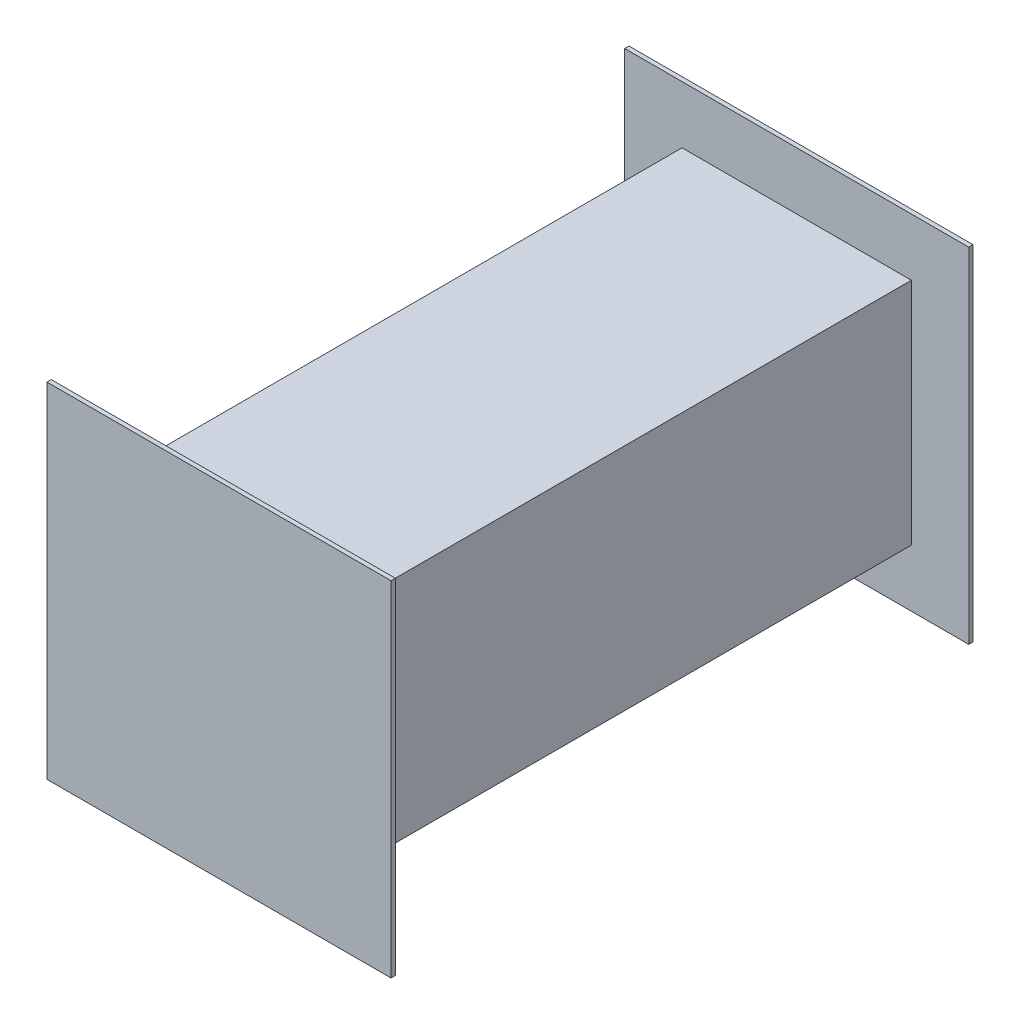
ISO-10303-21;
HEADER;
FILE_DESCRIPTION(('STEP AP214'),'2;1');
FILE_NAME('part.step','',(''),(''),'','','');
FILE_SCHEMA(('AUTOMOTIVE_DESIGN { 1 0 10303 214 1 1 1 1 }'));
ENDSEC;
DATA;
#1=APPLICATION_CONTEXT('core data for automotive mechanical design processes');
#2=APPLICATION_PROTOCOL_DEFINITION('international standard','automotive_design',2000,#1);
#3=PRODUCT_CONTEXT('',#1,'mechanical');
#4=PRODUCT('Part','Part','',(#3));
#5=PRODUCT_RELATED_PRODUCT_CATEGORY('part','',(#4));
#6=PRODUCT_DEFINITION_FORMATION('','',#4);
#7=PRODUCT_DEFINITION_CONTEXT('part definition',#1,'design');
#8=PRODUCT_DEFINITION('design','',#6,#7);
#9=PRODUCT_DEFINITION_SHAPE('','',#8);
#10=(LENGTH_UNIT() NAMED_UNIT(*) SI_UNIT(.MILLI.,.METRE.));
#11=(NAMED_UNIT(*) PLANE_ANGLE_UNIT() SI_UNIT($,.RADIAN.));
#12=(NAMED_UNIT(*) SI_UNIT($,.STERADIAN.) SOLID_ANGLE_UNIT());
#13=UNCERTAINTY_MEASURE_WITH_UNIT(LENGTH_MEASURE(1.E-05),#10,'distance_accuracy_value','');
#14=(GEOMETRIC_REPRESENTATION_CONTEXT(3) GLOBAL_UNCERTAINTY_ASSIGNED_CONTEXT((#13)) GLOBAL_UNIT_ASSIGNED_CONTEXT((#10,
#11,#12)) REPRESENTATION_CONTEXT('',''));
#15=CARTESIAN_POINT('',(0.,0.,0.));
#16=DIRECTION('',(0.,0.,1.));
#17=DIRECTION('',(1.,0.,0.));
#18=AXIS2_PLACEMENT_3D('',#15,#16,#17);
#19=CARTESIAN_POINT('',(-40.,40.,50.));
#20=DIRECTION('',(1.,0.,0.));
#21=DIRECTION('',(0.,1.,0.));
#22=AXIS2_PLACEMENT_3D('',#19,#20,#21);
#23=PLANE('',#22);
#24=DIRECTION('',(0.,0.,-1.));
#25=VECTOR('',#24,1.);
#26=CARTESIAN_POINT('',(-40.,40.,50.));
#27=LINE('',#26,#25);
#28=CARTESIAN_POINT('',(-40.,40.,50.));
#29=VERTEX_POINT('',#28);
#30=CARTESIAN_POINT('',(-40.,40.,-150.));
#31=VERTEX_POINT('',#30);
#32=EDGE_CURVE('E612',#29,#31,#27,.T.);
#33=ORIENTED_EDGE('',*,*,#32,.T.);
#34=DIRECTION('',(0.,-1.,0.));
#35=VECTOR('',#34,1.);
#36=CARTESIAN_POINT('',(-40.,40.,-150.));
#37=LINE('',#36,#35);
#38=CARTESIAN_POINT('',(-40.,-40.,-150.));
#39=VERTEX_POINT('',#38);
#40=EDGE_CURVE('E539',#31,#39,#37,.T.);
#41=ORIENTED_EDGE('',*,*,#40,.T.);
#42=DIRECTION('',(0.,0.,-1.));
#43=VECTOR('',#42,1.);
#44=CARTESIAN_POINT('',(-40.,-40.,50.));
#45=LINE('',#44,#43);
#46=CARTESIAN_POINT('',(-40.,-40.,50.));
#47=VERTEX_POINT('',#46);
#48=EDGE_CURVE('E11',#47,#39,#45,.T.);
#49=ORIENTED_EDGE('',*,*,#48,.F.);
#50=DIRECTION('',(0.,-1.,0.));
#51=VECTOR('',#50,1.);
#52=CARTESIAN_POINT('',(-40.,40.,50.));
#53=LINE('',#52,#51);
#54=EDGE_CURVE('E600',#29,#47,#53,.T.);
#55=ORIENTED_EDGE('',*,*,#54,.F.);
#56=EDGE_LOOP('',(#33,#41,#49,#55));
#57=FACE_BOUND('',#56,.T.);
#58=ADVANCED_FACE('F370',(#57),#23,.F.);
#59=CARTESIAN_POINT('',(-40.,-40.,50.));
#60=DIRECTION('',(0.,1.,0.));
#61=DIRECTION('',(0.,0.,1.));
#62=AXIS2_PLACEMENT_3D('',#59,#60,#61);
#63=PLANE('',#62);
#64=ORIENTED_EDGE('',*,*,#48,.T.);
#65=DIRECTION('',(1.,0.,0.));
#66=VECTOR('',#65,1.);
#67=CARTESIAN_POINT('',(-40.,-40.,-150.));
#68=LINE('',#67,#66);
#69=CARTESIAN_POINT('',(40.,-40.,-150.));
#70=VERTEX_POINT('',#69);
#71=EDGE_CURVE('E547',#39,#70,#68,.T.);
#72=ORIENTED_EDGE('',*,*,#71,.T.);
#73=DIRECTION('',(0.,0.,-1.));
#74=VECTOR('',#73,1.);
#75=CARTESIAN_POINT('',(40.,-40.,50.));
#76=LINE('',#75,#74);
#77=CARTESIAN_POINT('',(40.,-40.,50.));
#78=VERTEX_POINT('',#77);
#79=EDGE_CURVE('E378',#78,#70,#76,.T.);
#80=ORIENTED_EDGE('',*,*,#79,.F.);
#81=DIRECTION('',(1.,0.,0.));
#82=VECTOR('',#81,1.);
#83=CARTESIAN_POINT('',(-40.,-40.,50.));
#84=LINE('',#83,#82);
#85=EDGE_CURVE('E603',#47,#78,#84,.T.);
#86=ORIENTED_EDGE('',*,*,#85,.F.);
#87=EDGE_LOOP('',(#64,#72,#80,#86));
#88=FACE_BOUND('',#87,.T.);
#89=ADVANCED_FACE('F616',(#88),#63,.F.);
#90=CARTESIAN_POINT('',(40.,40.,50.));
#91=DIRECTION('',(-1.,0.,0.));
#92=DIRECTION('',(0.,-1.,0.));
#93=AXIS2_PLACEMENT_3D('',#90,#91,#92);
#94=PLANE('',#93);
#95=ORIENTED_EDGE('',*,*,#79,.T.);
#96=DIRECTION('',(0.,1.,0.));
#97=VECTOR('',#96,1.);
#98=CARTESIAN_POINT('',(40.,40.,-150.));
#99=LINE('',#98,#97);
#100=CARTESIAN_POINT('',(40.,40.,-150.));
#101=VERTEX_POINT('',#100);
#102=EDGE_CURVE('E545',#70,#101,#99,.T.);
#103=ORIENTED_EDGE('',*,*,#102,.T.);
#104=DIRECTION('',(0.,0.,-1.));
#105=VECTOR('',#104,1.);
#106=CARTESIAN_POINT('',(40.,40.,50.));
#107=LINE('',#106,#105);
#108=CARTESIAN_POINT('',(40.,40.,50.));
#109=VERTEX_POINT('',#108);
#110=EDGE_CURVE('E385',#109,#101,#107,.T.);
#111=ORIENTED_EDGE('',*,*,#110,.F.);
#112=DIRECTION('',(0.,1.,0.));
#113=VECTOR('',#112,1.);
#114=CARTESIAN_POINT('',(40.,40.,50.));
#115=LINE('',#114,#113);
#116=EDGE_CURVE('E606',#78,#109,#115,.T.);
#117=ORIENTED_EDGE('',*,*,#116,.F.);
#118=EDGE_LOOP('',(#95,#103,#111,#117));
#119=FACE_BOUND('',#118,.T.);
#120=ADVANCED_FACE('F615',(#119),#94,.F.);
#121=CARTESIAN_POINT('',(-40.,40.,50.));
#122=DIRECTION('',(0.,-1.,0.));
#123=DIRECTION('',(0.,0.,-1.));
#124=AXIS2_PLACEMENT_3D('',#121,#122,#123);
#125=PLANE('',#124);
#126=ORIENTED_EDGE('',*,*,#110,.T.);
#127=DIRECTION('',(-1.,0.,0.));
#128=VECTOR('',#127,1.);
#129=CARTESIAN_POINT('',(-40.,40.,-150.));
#130=LINE('',#129,#128);
#131=EDGE_CURVE('E542',#101,#31,#130,.T.);
#132=ORIENTED_EDGE('',*,*,#131,.T.);
#133=ORIENTED_EDGE('',*,*,#32,.F.);
#134=DIRECTION('',(-1.,0.,0.));
#135=VECTOR('',#134,1.);
#136=CARTESIAN_POINT('',(-40.,40.,50.));
#137=LINE('',#136,#135);
#138=EDGE_CURVE('E609',#109,#29,#137,.T.);
#139=ORIENTED_EDGE('',*,*,#138,.F.);
#140=EDGE_LOOP('',(#126,#132,#133,#139));
#141=FACE_BOUND('',#140,.T.);
#142=ADVANCED_FACE('F620',(#141),#125,.F.);
#143=CARTESIAN_POINT('',(-60.,60.,50.));
#144=DIRECTION('',(0.,0.,1.));
#145=DIRECTION('',(1.,0.,0.));
#146=AXIS2_PLACEMENT_3D('',#143,#144,#145);
#147=PLANE('',#146);
#148=DIRECTION('',(0.,-1.,0.));
#149=VECTOR('',#148,1.);
#150=CARTESIAN_POINT('',(-60.,60.,50.));
#151=LINE('',#150,#149);
#152=CARTESIAN_POINT('',(-60.,60.,50.));
#153=VERTEX_POINT('',#152);
#154=CARTESIAN_POINT('',(-60.,-60.,50.));
#155=VERTEX_POINT('',#154);
#156=EDGE_CURVE('E549',#153,#155,#151,.T.);
#157=ORIENTED_EDGE('',*,*,#156,.F.);
#158=DIRECTION('',(-1.,0.,0.));
#159=VECTOR('',#158,1.);
#160=CARTESIAN_POINT('',(-60.,60.,50.));
#161=LINE('',#160,#159);
#162=CARTESIAN_POINT('',(60.,60.,50.));
#163=VERTEX_POINT('',#162);
#164=EDGE_CURVE('E556',#163,#153,#161,.T.);
#165=ORIENTED_EDGE('',*,*,#164,.F.);
#166=DIRECTION('',(0.,1.,0.));
#167=VECTOR('',#166,1.);
#168=CARTESIAN_POINT('',(60.,60.,50.));
#169=LINE('',#168,#167);
#170=CARTESIAN_POINT('',(60.,-60.,50.));
#171=VERTEX_POINT('',#170);
#172=EDGE_CURVE('E554',#171,#163,#169,.T.);
#173=ORIENTED_EDGE('',*,*,#172,.F.);
#174=DIRECTION('',(1.,0.,0.));
#175=VECTOR('',#174,1.);
#176=CARTESIAN_POINT('',(-60.,-60.,50.));
#177=LINE('',#176,#175);
#178=EDGE_CURVE('E552',#155,#171,#177,.T.);
#179=ORIENTED_EDGE('',*,*,#178,.F.);
#180=EDGE_LOOP('',(#157,#165,#173,#179));
#181=FACE_BOUND('',#180,.T.);
#182=ORIENTED_EDGE('',*,*,#138,.T.);
#183=ORIENTED_EDGE('',*,*,#54,.T.);
#184=ORIENTED_EDGE('',*,*,#85,.T.);
#185=ORIENTED_EDGE('',*,*,#116,.T.);
#186=EDGE_LOOP('',(#182,#183,#184,#185));
#187=FACE_BOUND('',#186,.T.);
#188=ADVANCED_FACE('F622',(#181,#187),#147,.F.);
#189=CARTESIAN_POINT('',(-60.,60.,51.5));
#190=DIRECTION('',(1.,0.,0.));
#191=DIRECTION('',(0.,1.,0.));
#192=AXIS2_PLACEMENT_3D('',#189,#190,#191);
#193=PLANE('',#192);
#194=ORIENTED_EDGE('',*,*,#156,.T.);
#195=DIRECTION('',(0.,0.,-1.));
#196=VECTOR('',#195,1.);
#197=CARTESIAN_POINT('',(-60.,-60.,51.5));
#198=LINE('',#197,#196);
#199=CARTESIAN_POINT('',(-60.,-60.,51.5));
#200=VERTEX_POINT('',#199);
#201=EDGE_CURVE('E576',#200,#155,#198,.T.);
#202=ORIENTED_EDGE('',*,*,#201,.F.);
#203=DIRECTION('',(0.,-1.,0.));
#204=VECTOR('',#203,1.);
#205=CARTESIAN_POINT('',(-60.,60.,51.5));
#206=LINE('',#205,#204);
#207=CARTESIAN_POINT('',(-60.,60.,51.5));
#208=VERTEX_POINT('',#207);
#209=EDGE_CURVE('E558',#208,#200,#206,.T.);
#210=ORIENTED_EDGE('',*,*,#209,.F.);
#211=DIRECTION('',(0.,0.,-1.));
#212=VECTOR('',#211,1.);
#213=CARTESIAN_POINT('',(-60.,60.,51.5));
#214=LINE('',#213,#212);
#215=EDGE_CURVE('E567',#208,#153,#214,.T.);
#216=ORIENTED_EDGE('',*,*,#215,.T.);
#217=EDGE_LOOP('',(#194,#202,#210,#216));
#218=FACE_BOUND('',#217,.T.);
#219=ADVANCED_FACE('F654',(#218),#193,.F.);
#220=CARTESIAN_POINT('',(-60.,-60.,51.5));
#221=DIRECTION('',(0.,1.,0.));
#222=DIRECTION('',(-1.,0.,0.));
#223=AXIS2_PLACEMENT_3D('',#220,#221,#222);
#224=PLANE('',#223);
#225=ORIENTED_EDGE('',*,*,#178,.T.);
#226=DIRECTION('',(0.,0.,-1.));
#227=VECTOR('',#226,1.);
#228=CARTESIAN_POINT('',(60.,-60.,51.5));
#229=LINE('',#228,#227);
#230=CARTESIAN_POINT('',(60.,-60.,51.5));
#231=VERTEX_POINT('',#230);
#232=EDGE_CURVE('E573',#231,#171,#229,.T.);
#233=ORIENTED_EDGE('',*,*,#232,.F.);
#234=DIRECTION('',(1.,0.,0.));
#235=VECTOR('',#234,1.);
#236=CARTESIAN_POINT('',(-60.,-60.,51.5));
#237=LINE('',#236,#235);
#238=EDGE_CURVE('E561',#200,#231,#237,.T.);
#239=ORIENTED_EDGE('',*,*,#238,.F.);
#240=ORIENTED_EDGE('',*,*,#201,.T.);
#241=EDGE_LOOP('',(#225,#233,#239,#240));
#242=FACE_BOUND('',#241,.T.);
#243=ADVANCED_FACE('F657',(#242),#224,.F.);
#244=CARTESIAN_POINT('',(60.,60.,51.5));
#245=DIRECTION('',(-1.,0.,0.));
#246=DIRECTION('',(0.,-1.,0.));
#247=AXIS2_PLACEMENT_3D('',#244,#245,#246);
#248=PLANE('',#247);
#249=ORIENTED_EDGE('',*,*,#172,.T.);
#250=DIRECTION('',(0.,0.,-1.));
#251=VECTOR('',#250,1.);
#252=CARTESIAN_POINT('',(60.,60.,51.5));
#253=LINE('',#252,#251);
#254=CARTESIAN_POINT('',(60.,60.,51.5));
#255=VERTEX_POINT('',#254);
#256=EDGE_CURVE('E570',#255,#163,#253,.T.);
#257=ORIENTED_EDGE('',*,*,#256,.F.);
#258=DIRECTION('',(0.,1.,0.));
#259=VECTOR('',#258,1.);
#260=CARTESIAN_POINT('',(60.,60.,51.5));
#261=LINE('',#260,#259);
#262=EDGE_CURVE('E563',#231,#255,#261,.T.);
#263=ORIENTED_EDGE('',*,*,#262,.F.);
#264=ORIENTED_EDGE('',*,*,#232,.T.);
#265=EDGE_LOOP('',(#249,#257,#263,#264));
#266=FACE_BOUND('',#265,.T.);
#267=ADVANCED_FACE('F661',(#266),#248,.F.);
#268=CARTESIAN_POINT('',(-60.,60.,51.5));
#269=DIRECTION('',(0.,-1.,0.));
#270=DIRECTION('',(0.,0.,-1.));
#271=AXIS2_PLACEMENT_3D('',#268,#269,#270);
#272=PLANE('',#271);
#273=ORIENTED_EDGE('',*,*,#164,.T.);
#274=ORIENTED_EDGE('',*,*,#215,.F.);
#275=DIRECTION('',(-1.,0.,0.));
#276=VECTOR('',#275,1.);
#277=CARTESIAN_POINT('',(-60.,60.,51.5));
#278=LINE('',#277,#276);
#279=EDGE_CURVE('E565',#255,#208,#278,.T.);
#280=ORIENTED_EDGE('',*,*,#279,.F.);
#281=ORIENTED_EDGE('',*,*,#256,.T.);
#282=EDGE_LOOP('',(#273,#274,#280,#281));
#283=FACE_BOUND('',#282,.T.);
#284=ADVANCED_FACE('F665',(#283),#272,.F.);
#285=CARTESIAN_POINT('',(-60.,60.,51.5));
#286=DIRECTION('',(0.,0.,1.));
#287=DIRECTION('',(1.,0.,0.));
#288=AXIS2_PLACEMENT_3D('',#285,#286,#287);
#289=PLANE('',#288);
#290=ORIENTED_EDGE('',*,*,#209,.T.);
#291=ORIENTED_EDGE('',*,*,#238,.T.);
#292=ORIENTED_EDGE('',*,*,#262,.T.);
#293=ORIENTED_EDGE('',*,*,#279,.T.);
#294=EDGE_LOOP('',(#290,#291,#292,#293));
#295=FACE_BOUND('',#294,.T.);
#296=ADVANCED_FACE('F669',(#295),#289,.T.);
#297=CARTESIAN_POINT('',(-60.,60.,-150.));
#298=DIRECTION('',(0.,0.,-1.));
#299=DIRECTION('',(1.,0.,0.));
#300=AXIS2_PLACEMENT_3D('',#297,#298,#299);
#301=PLANE('',#300);
#302=DIRECTION('',(0.,-1.,0.));
#303=VECTOR('',#302,1.);
#304=CARTESIAN_POINT('',(-60.,60.,-150.));
#305=LINE('',#304,#303);
#306=CARTESIAN_POINT('',(-60.,60.,-150.));
#307=VERTEX_POINT('',#306);
#308=CARTESIAN_POINT('',(-60.,-60.,-150.));
#309=VERTEX_POINT('',#308);
#310=EDGE_CURVE('E499',#307,#309,#305,.T.);
#311=ORIENTED_EDGE('',*,*,#310,.T.);
#312=DIRECTION('',(1.,0.,0.));
#313=VECTOR('',#312,1.);
#314=CARTESIAN_POINT('',(-60.,-60.,-150.));
#315=LINE('',#314,#313);
#316=CARTESIAN_POINT('',(60.,-60.,-150.));
#317=VERTEX_POINT('',#316);
#318=EDGE_CURVE('E511',#309,#317,#315,.T.);
#319=ORIENTED_EDGE('',*,*,#318,.T.);
#320=DIRECTION('',(0.,1.,0.));
#321=VECTOR('',#320,1.);
#322=CARTESIAN_POINT('',(60.,60.,-150.));
#323=LINE('',#322,#321);
#324=CARTESIAN_POINT('',(60.,60.,-150.));
#325=VERTEX_POINT('',#324);
#326=EDGE_CURVE('E509',#317,#325,#323,.T.);
#327=ORIENTED_EDGE('',*,*,#326,.T.);
#328=DIRECTION('',(-1.,0.,0.));
#329=VECTOR('',#328,1.);
#330=CARTESIAN_POINT('',(-60.,60.,-150.));
#331=LINE('',#330,#329);
#332=EDGE_CURVE('E488',#325,#307,#331,.T.);
#333=ORIENTED_EDGE('',*,*,#332,.T.);
#334=EDGE_LOOP('',(#311,#319,#327,#333));
#335=FACE_BOUND('',#334,.T.);
#336=ORIENTED_EDGE('',*,*,#71,.F.);
#337=ORIENTED_EDGE('',*,*,#40,.F.);
#338=ORIENTED_EDGE('',*,*,#131,.F.);
#339=ORIENTED_EDGE('',*,*,#102,.F.);
#340=EDGE_LOOP('',(#336,#337,#338,#339));
#341=FACE_BOUND('',#340,.T.);
#342=ADVANCED_FACE('F506',(#335,#341),#301,.F.);
#343=CARTESIAN_POINT('',(-60.,60.,-151.5));
#344=DIRECTION('',(-1.,0.,0.));
#345=DIRECTION('',(0.,-1.,0.));
#346=AXIS2_PLACEMENT_3D('',#343,#344,#345);
#347=PLANE('',#346);
#348=ORIENTED_EDGE('',*,*,#310,.F.);
#349=DIRECTION('',(0.,0.,1.));
#350=VECTOR('',#349,1.);
#351=CARTESIAN_POINT('',(-60.,60.,-151.5));
#352=LINE('',#351,#350);
#353=CARTESIAN_POINT('',(-60.,60.,-151.5));
#354=VERTEX_POINT('',#353);
#355=EDGE_CURVE('E484',#354,#307,#352,.T.);
#356=ORIENTED_EDGE('',*,*,#355,.F.);
#357=DIRECTION('',(0.,-1.,0.));
#358=VECTOR('',#357,1.);
#359=CARTESIAN_POINT('',(-60.,60.,-151.5));
#360=LINE('',#359,#358);
#361=CARTESIAN_POINT('',(-60.,-60.,-151.5));
#362=VERTEX_POINT('',#361);
#363=EDGE_CURVE('E515',#354,#362,#360,.T.);
#364=ORIENTED_EDGE('',*,*,#363,.T.);
#365=DIRECTION('',(0.,0.,1.));
#366=VECTOR('',#365,1.);
#367=CARTESIAN_POINT('',(-60.,-60.,-151.5));
#368=LINE('',#367,#366);
#369=EDGE_CURVE('E501',#362,#309,#368,.T.);
#370=ORIENTED_EDGE('',*,*,#369,.T.);
#371=EDGE_LOOP('',(#348,#356,#364,#370));
#372=FACE_BOUND('',#371,.T.);
#373=ADVANCED_FACE('F500',(#372),#347,.T.);
#374=CARTESIAN_POINT('',(-60.,60.,-151.5));
#375=DIRECTION('',(0.,1.,0.));
#376=DIRECTION('',(0.,0.,1.));
#377=AXIS2_PLACEMENT_3D('',#374,#375,#376);
#378=PLANE('',#377);
#379=ORIENTED_EDGE('',*,*,#332,.F.);
#380=DIRECTION('',(0.,0.,1.));
#381=VECTOR('',#380,1.);
#382=CARTESIAN_POINT('',(60.,60.,-151.5));
#383=LINE('',#382,#381);
#384=CARTESIAN_POINT('',(60.,60.,-151.5));
#385=VERTEX_POINT('',#384);
#386=EDGE_CURVE('E496',#385,#325,#383,.T.);
#387=ORIENTED_EDGE('',*,*,#386,.F.);
#388=DIRECTION('',(-1.,0.,0.));
#389=VECTOR('',#388,1.);
#390=CARTESIAN_POINT('',(-60.,60.,-151.5));
#391=LINE('',#390,#389);
#392=EDGE_CURVE('E491',#385,#354,#391,.T.);
#393=ORIENTED_EDGE('',*,*,#392,.T.);
#394=ORIENTED_EDGE('',*,*,#355,.T.);
#395=EDGE_LOOP('',(#379,#387,#393,#394));
#396=FACE_BOUND('',#395,.T.);
#397=ADVANCED_FACE('F486',(#396),#378,.T.);
#398=CARTESIAN_POINT('',(60.,60.,-151.5));
#399=DIRECTION('',(1.,0.,0.));
#400=DIRECTION('',(0.,1.,0.));
#401=AXIS2_PLACEMENT_3D('',#398,#399,#400);
#402=PLANE('',#401);
#403=ORIENTED_EDGE('',*,*,#326,.F.);
#404=DIRECTION('',(0.,0.,1.));
#405=VECTOR('',#404,1.);
#406=CARTESIAN_POINT('',(60.,-60.,-151.5));
#407=LINE('',#406,#405);
#408=CARTESIAN_POINT('',(60.,-60.,-151.5));
#409=VERTEX_POINT('',#408);
#410=EDGE_CURVE('E525',#409,#317,#407,.T.);
#411=ORIENTED_EDGE('',*,*,#410,.F.);
#412=DIRECTION('',(0.,1.,0.));
#413=VECTOR('',#412,1.);
#414=CARTESIAN_POINT('',(60.,60.,-151.5));
#415=LINE('',#414,#413);
#416=EDGE_CURVE('E518',#409,#385,#415,.T.);
#417=ORIENTED_EDGE('',*,*,#416,.T.);
#418=ORIENTED_EDGE('',*,*,#386,.T.);
#419=EDGE_LOOP('',(#403,#411,#417,#418));
#420=FACE_BOUND('',#419,.T.);
#421=ADVANCED_FACE('F681',(#420),#402,.T.);
#422=CARTESIAN_POINT('',(-60.,-60.,-151.5));
#423=DIRECTION('',(0.,-1.,0.));
#424=DIRECTION('',(1.,0.,0.));
#425=AXIS2_PLACEMENT_3D('',#422,#423,#424);
#426=PLANE('',#425);
#427=ORIENTED_EDGE('',*,*,#318,.F.);
#428=ORIENTED_EDGE('',*,*,#369,.F.);
#429=DIRECTION('',(1.,0.,0.));
#430=VECTOR('',#429,1.);
#431=CARTESIAN_POINT('',(-60.,-60.,-151.5));
#432=LINE('',#431,#430);
#433=EDGE_CURVE('E521',#362,#409,#432,.T.);
#434=ORIENTED_EDGE('',*,*,#433,.T.);
#435=ORIENTED_EDGE('',*,*,#410,.T.);
#436=EDGE_LOOP('',(#427,#428,#434,#435));
#437=FACE_BOUND('',#436,.T.);
#438=ADVANCED_FACE('F684',(#437),#426,.T.);
#439=CARTESIAN_POINT('',(-60.,60.,-151.5));
#440=DIRECTION('',(0.,0.,-1.));
#441=DIRECTION('',(1.,0.,0.));
#442=AXIS2_PLACEMENT_3D('',#439,#440,#441);
#443=PLANE('',#442);
#444=ORIENTED_EDGE('',*,*,#363,.F.);
#445=ORIENTED_EDGE('',*,*,#392,.F.);
#446=ORIENTED_EDGE('',*,*,#416,.F.);
#447=ORIENTED_EDGE('',*,*,#433,.F.);
#448=EDGE_LOOP('',(#444,#445,#446,#447));
#449=FACE_BOUND('',#448,.T.);
#450=ADVANCED_FACE('F688',(#449),#443,.T.);
#451=CLOSED_SHELL('',(#58,#89,#120,#142,#188,#219,#243,#267,#284,#296,#342,#373,#397,#421,#438,#450));
#452=DIRECTION('',(-1.,0.,0.));
#453=VECTOR('',#452,1.);
#454=CARTESIAN_POINT('',(-37.,37.,-150.));
#455=LINE('',#454,#453);
#456=CARTESIAN_POINT('',(37.,37.,-150.));
#457=VERTEX_POINT('',#456);
#458=CARTESIAN_POINT('',(-37.,37.,-150.));
#459=VERTEX_POINT('',#458);
#460=EDGE_CURVE('E530',#457,#459,#455,.T.);
#461=ORIENTED_EDGE('',*,*,#460,.T.);
#462=DIRECTION('',(0.,-1.,0.));
#463=VECTOR('',#462,1.);
#464=CARTESIAN_POINT('',(-37.,37.,-150.));
#465=LINE('',#464,#463);
#466=CARTESIAN_POINT('',(-37.,-37.,-150.));
#467=VERTEX_POINT('',#466);
#468=EDGE_CURVE('E495',#459,#467,#465,.T.);
#469=ORIENTED_EDGE('',*,*,#468,.T.);
#470=DIRECTION('',(1.,0.,0.));
#471=VECTOR('',#470,1.);
#472=CARTESIAN_POINT('',(-37.,-37.,-150.));
#473=LINE('',#472,#471);
#474=CARTESIAN_POINT('',(37.,-37.,-150.));
#475=VERTEX_POINT('',#474);
#476=EDGE_CURVE('E536',#467,#475,#473,.T.);
#477=ORIENTED_EDGE('',*,*,#476,.T.);
#478=DIRECTION('',(0.,1.,0.));
#479=VECTOR('',#478,1.);
#480=CARTESIAN_POINT('',(37.,37.,-150.));
#481=LINE('',#480,#479);
#482=EDGE_CURVE('E533',#475,#457,#481,.T.);
#483=ORIENTED_EDGE('',*,*,#482,.T.);
#484=EDGE_LOOP('',(#461,#469,#477,#483));
#485=FACE_BOUND('',#484,.T.);
#486=ADVANCED_FACE('F675',(#485),#301,.F.);
#487=DIRECTION('',(0.,-1.,0.));
#488=VECTOR('',#487,1.);
#489=CARTESIAN_POINT('',(-37.,37.,50.));
#490=LINE('',#489,#488);
#491=CARTESIAN_POINT('',(-37.,37.,50.));
#492=VERTEX_POINT('',#491);
#493=CARTESIAN_POINT('',(-37.,-37.,50.));
#494=VERTEX_POINT('',#493);
#495=EDGE_CURVE('E579',#492,#494,#490,.T.);
#496=ORIENTED_EDGE('',*,*,#495,.F.);
#497=DIRECTION('',(-1.,0.,0.));
#498=VECTOR('',#497,1.);
#499=CARTESIAN_POINT('',(-37.,37.,50.));
#500=LINE('',#499,#498);
#501=CARTESIAN_POINT('',(37.,37.,50.));
#502=VERTEX_POINT('',#501);
#503=EDGE_CURVE('E588',#502,#492,#500,.T.);
#504=ORIENTED_EDGE('',*,*,#503,.F.);
#505=DIRECTION('',(0.,1.,0.));
#506=VECTOR('',#505,1.);
#507=CARTESIAN_POINT('',(37.,37.,50.));
#508=LINE('',#507,#506);
#509=CARTESIAN_POINT('',(37.,-37.,50.));
#510=VERTEX_POINT('',#509);
#511=EDGE_CURVE('E585',#510,#502,#508,.T.);
#512=ORIENTED_EDGE('',*,*,#511,.F.);
#513=DIRECTION('',(1.,0.,0.));
#514=VECTOR('',#513,1.);
#515=CARTESIAN_POINT('',(-37.,-37.,50.));
#516=LINE('',#515,#514);
#517=EDGE_CURVE('E582',#494,#510,#516,.T.);
#518=ORIENTED_EDGE('',*,*,#517,.F.);
#519=EDGE_LOOP('',(#496,#504,#512,#518));
#520=FACE_BOUND('',#519,.T.);
#521=ADVANCED_FACE('F640',(#520),#147,.F.);
#522=CARTESIAN_POINT('',(-37.,37.,50.));
#523=DIRECTION('',(1.,0.,0.));
#524=DIRECTION('',(0.,1.,0.));
#525=AXIS2_PLACEMENT_3D('',#522,#523,#524);
#526=PLANE('',#525);
#527=DIRECTION('',(0.,0.,-1.));
#528=VECTOR('',#527,1.);
#529=CARTESIAN_POINT('',(-37.,-37.,50.));
#530=LINE('',#529,#528);
#531=EDGE_CURVE('E597',#494,#467,#530,.T.);
#532=ORIENTED_EDGE('',*,*,#531,.T.);
#533=ORIENTED_EDGE('',*,*,#468,.F.);
#534=DIRECTION('',(0.,0.,-1.));
#535=VECTOR('',#534,1.);
#536=CARTESIAN_POINT('',(-37.,37.,50.));
#537=LINE('',#536,#535);
#538=EDGE_CURVE('E591',#492,#459,#537,.T.);
#539=ORIENTED_EDGE('',*,*,#538,.F.);
#540=ORIENTED_EDGE('',*,*,#495,.T.);
#541=EDGE_LOOP('',(#532,#533,#539,#540));
#542=FACE_BOUND('',#541,.T.);
#543=ADVANCED_FACE('F636',(#542),#526,.T.);
#544=CARTESIAN_POINT('',(-37.,-37.,50.));
#545=DIRECTION('',(0.,1.,0.));
#546=DIRECTION('',(0.,0.,1.));
#547=AXIS2_PLACEMENT_3D('',#544,#545,#546);
#548=PLANE('',#547);
#549=DIRECTION('',(0.,0.,-1.));
#550=VECTOR('',#549,1.);
#551=CARTESIAN_POINT('',(37.,-37.,50.));
#552=LINE('',#551,#550);
#553=EDGE_CURVE('E595',#510,#475,#552,.T.);
#554=ORIENTED_EDGE('',*,*,#553,.T.);
#555=ORIENTED_EDGE('',*,*,#476,.F.);
#556=ORIENTED_EDGE('',*,*,#531,.F.);
#557=ORIENTED_EDGE('',*,*,#517,.T.);
#558=EDGE_LOOP('',(#554,#555,#556,#557));
#559=FACE_BOUND('',#558,.T.);
#560=ADVANCED_FACE('F639',(#559),#548,.T.);
#561=CARTESIAN_POINT('',(37.,37.,50.));
#562=DIRECTION('',(-1.,0.,0.));
#563=DIRECTION('',(0.,-1.,0.));
#564=AXIS2_PLACEMENT_3D('',#561,#562,#563);
#565=PLANE('',#564);
#566=DIRECTION('',(0.,0.,-1.));
#567=VECTOR('',#566,1.);
#568=CARTESIAN_POINT('',(37.,37.,50.));
#569=LINE('',#568,#567);
#570=EDGE_CURVE('E593',#502,#457,#569,.T.);
#571=ORIENTED_EDGE('',*,*,#570,.T.);
#572=ORIENTED_EDGE('',*,*,#482,.F.);
#573=ORIENTED_EDGE('',*,*,#553,.F.);
#574=ORIENTED_EDGE('',*,*,#511,.T.);
#575=EDGE_LOOP('',(#571,#572,#573,#574));
#576=FACE_BOUND('',#575,.T.);
#577=ADVANCED_FACE('F645',(#576),#565,.T.);
#578=CARTESIAN_POINT('',(-37.,37.,50.));
#579=DIRECTION('',(0.,-1.,0.));
#580=DIRECTION('',(0.,0.,-1.));
#581=AXIS2_PLACEMENT_3D('',#578,#579,#580);
#582=PLANE('',#581);
#583=ORIENTED_EDGE('',*,*,#538,.T.);
#584=ORIENTED_EDGE('',*,*,#460,.F.);
#585=ORIENTED_EDGE('',*,*,#570,.F.);
#586=ORIENTED_EDGE('',*,*,#503,.T.);
#587=EDGE_LOOP('',(#583,#584,#585,#586));
#588=FACE_BOUND('',#587,.T.);
#589=ADVANCED_FACE('F649',(#588),#582,.T.);
#590=CLOSED_SHELL('',(#486,#521,#543,#560,#577,#589));
#591=ORIENTED_CLOSED_SHELL('',*,#590,.T.);
#592=BREP_WITH_VOIDS('B2',#451,(#591));
#593=ADVANCED_BREP_SHAPE_REPRESENTATION('',(#18,#592),#14);
#594=SHAPE_DEFINITION_REPRESENTATION(#9,#593);
ENDSEC;
END-ISO-10303-21;
